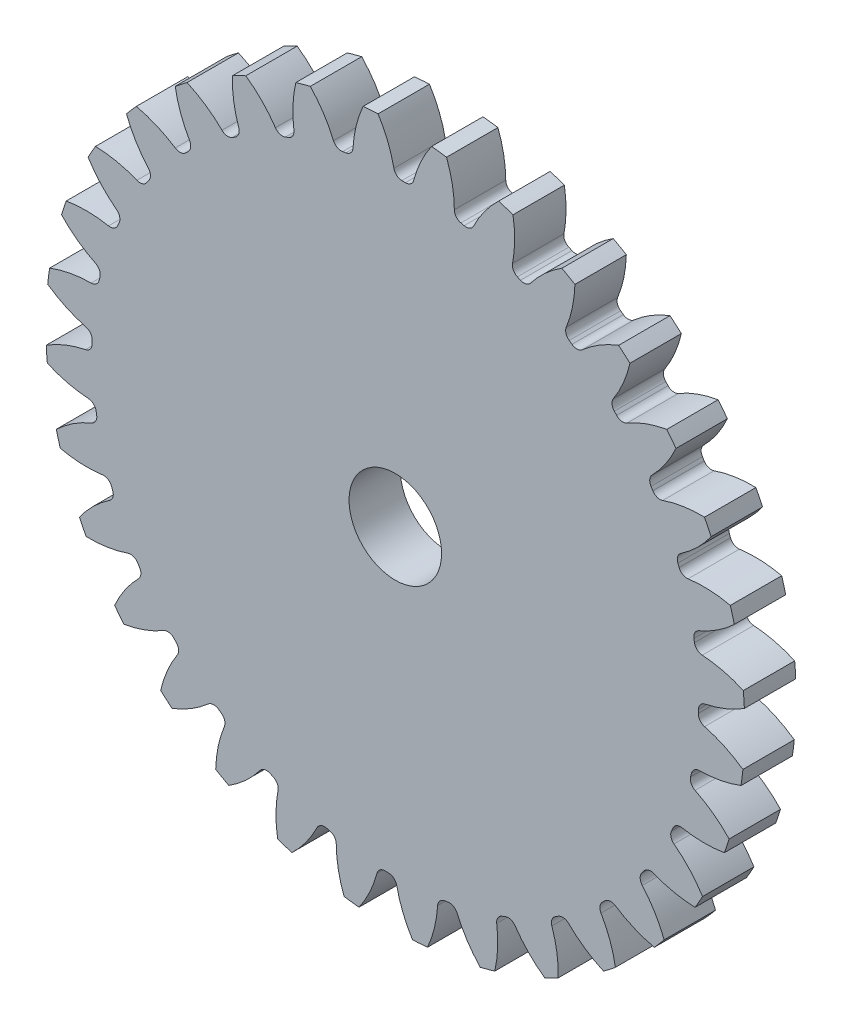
from build123d import *

# Parameters (mm, degrees)
SKETCH3_R         = 863.6
GEARBODY_DEPTH    = 127
TOOTHCUT_DEPTH    = 1228.900207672
CIRPATTERN1_COUNT = 32
BOREDIA_R         = 114.3
BORE_DEPTH        = 12700


with BuildPart() as part:
    # Sketch3 → gearBody (new body)
    with BuildSketch(Plane.XY):
        Circle(SKETCH3_R)
    extrude(amount=GEARBODY_DEPTH)

    # Sketch2 → toothCut (cut, through all)
    with BuildSketch(Plane.XY):
        with BuildLine():
            ThreePointArc((748.892137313, -24.719560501), (749.019280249, -20.508725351), (749.122746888, -16.297241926))
            ThreePointArc((749.122746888, -16.297241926), (753.899392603, -3.523502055), (765.591100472, 3.497092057))
            ThreePointArc((765.591100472, 3.497092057), (816.389533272, 18.921759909), (863.6, 43.202883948))
            ThreePointArc((863.6, 43.202883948), (864.356023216, -23.666734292), (859.941992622, -90.394792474))
            ThreePointArc((859.941992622, -90.394792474), (814.130936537, -63.566667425), (764.252660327, -45.385393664))
            ThreePointArc((764.252660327, -45.385393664), (752.96264057, -37.735542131), (748.892137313, -24.719560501))
        make_face()
    toothcut = extrude(amount=TOOTHCUT_DEPTH, mode=Mode.SUBTRACT)

    # CirPattern1: toothCut ×32 about axis
    cirpattern1_axis = Axis((0, 0, 0), (0, 0, 1))
    for i in range(1, CIRPATTERN1_COUNT):
        add(toothcut.rotate(cirpattern1_axis, i * 360 / CIRPATTERN1_COUNT), mode=Mode.SUBTRACT)

    # boreDia → bore (cut, symmetric)
    with BuildSketch(Plane.XY):
        Circle(BOREDIA_R)
    extrude(amount=BORE_DEPTH, both=True, mode=Mode.SUBTRACT)


solid = part.part
